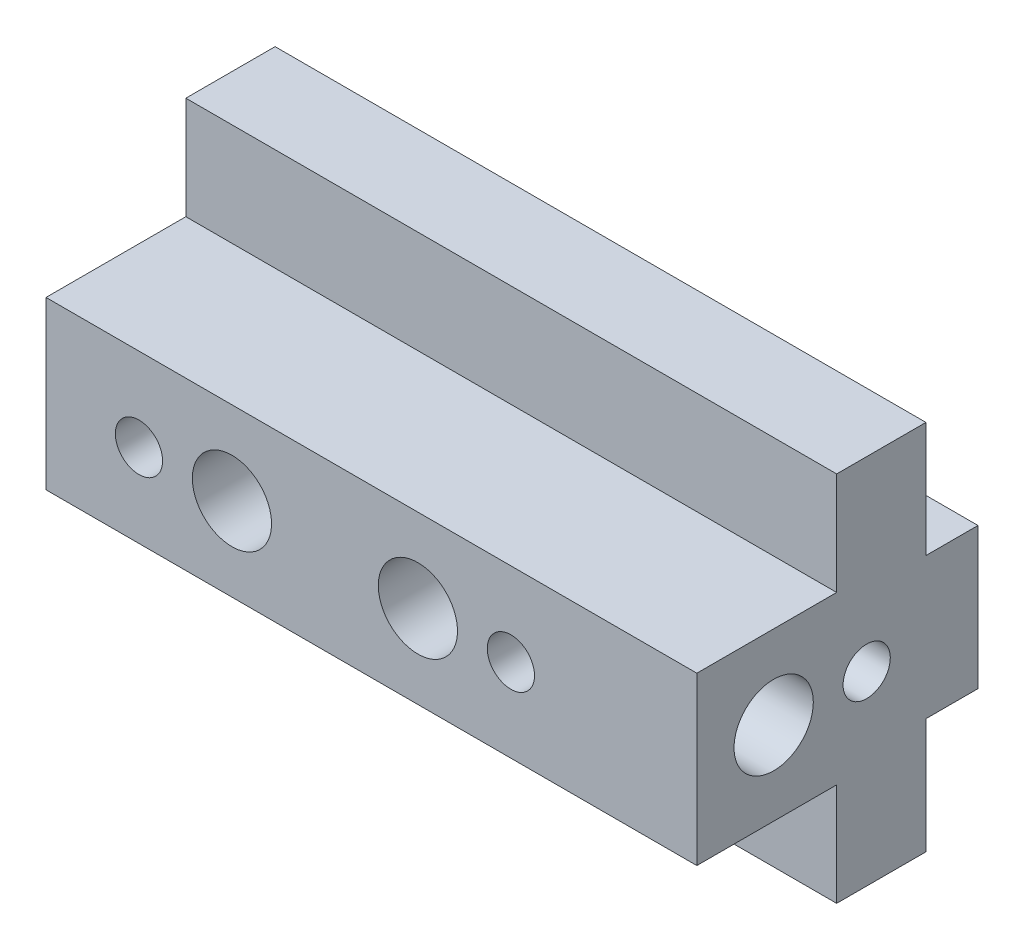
ISO-10303-21;
HEADER;
FILE_DESCRIPTION(('STEP AP214'),'2;1');
FILE_NAME('part.step','',(''),(''),'','','');
FILE_SCHEMA(('AUTOMOTIVE_DESIGN { 1 0 10303 214 1 1 1 1 }'));
ENDSEC;
DATA;
#1=APPLICATION_CONTEXT('core data for automotive mechanical design processes');
#2=APPLICATION_PROTOCOL_DEFINITION('international standard','automotive_design',2000,#1);
#3=PRODUCT_CONTEXT('',#1,'mechanical');
#4=PRODUCT('Part','Part','',(#3));
#5=PRODUCT_RELATED_PRODUCT_CATEGORY('part','',(#4));
#6=PRODUCT_DEFINITION_FORMATION('','',#4);
#7=PRODUCT_DEFINITION_CONTEXT('part definition',#1,'design');
#8=PRODUCT_DEFINITION('design','',#6,#7);
#9=PRODUCT_DEFINITION_SHAPE('','',#8);
#10=(LENGTH_UNIT() NAMED_UNIT(*) SI_UNIT(.MILLI.,.METRE.));
#11=(NAMED_UNIT(*) PLANE_ANGLE_UNIT() SI_UNIT($,.RADIAN.));
#12=(NAMED_UNIT(*) SI_UNIT($,.STERADIAN.) SOLID_ANGLE_UNIT());
#13=UNCERTAINTY_MEASURE_WITH_UNIT(LENGTH_MEASURE(1.E-05),#10,'distance_accuracy_value','');
#14=(GEOMETRIC_REPRESENTATION_CONTEXT(3) GLOBAL_UNCERTAINTY_ASSIGNED_CONTEXT((#13)) GLOBAL_UNIT_ASSIGNED_CONTEXT((#10,
#11,#12)) REPRESENTATION_CONTEXT('',''));
#15=CARTESIAN_POINT('',(0.,0.,0.));
#16=DIRECTION('',(0.,0.,1.));
#17=DIRECTION('',(1.,0.,0.));
#18=AXIS2_PLACEMENT_3D('',#15,#16,#17);
#19=CARTESIAN_POINT('',(7.30249999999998,0.123074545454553,2.81178));
#20=DIRECTION('',(1.,0.,0.));
#21=DIRECTION('',(0.,0.,-1.));
#22=AXIS2_PLACEMENT_3D('',#19,#20,#21);
#23=PLANE('',#22);
#24=CARTESIAN_POINT('',(7.30249999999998,0.,2.81178));
#25=DIRECTION('',(1.,0.,0.));
#26=DIRECTION('',(0.,0.,-1.));
#27=AXIS2_PLACEMENT_3D('',#24,#25,#26);
#28=CIRCLE('',#27,1.35382);
#29=CARTESIAN_POINT('',(7.30249999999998,0.,1.45796));
#30=VERTEX_POINT('',#29);
#31=EDGE_CURVE('E21',#30,#30,#28,.T.);
#32=ORIENTED_EDGE('',*,*,#31,.T.);
#33=EDGE_LOOP('',(#32));
#34=FACE_BOUND('',#33,.T.);
#35=ADVANCED_FACE('F17',(#34),#23,.T.);
#36=CARTESIAN_POINT('',(7.81049999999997,0.07331363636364,-0.364490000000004));
#37=DIRECTION('',(1.,0.,0.));
#38=DIRECTION('',(0.,0.,-1.));
#39=AXIS2_PLACEMENT_3D('',#36,#37,#38);
#40=PLANE('',#39);
#41=CARTESIAN_POINT('',(7.81049999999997,0.,-0.364490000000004));
#42=DIRECTION('',(1.,0.,0.));
#43=DIRECTION('',(0.,0.,-1.));
#44=AXIS2_PLACEMENT_3D('',#41,#42,#43);
#45=CIRCLE('',#44,0.80645);
#46=CARTESIAN_POINT('',(7.81049999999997,0.,-1.17094));
#47=VERTEX_POINT('',#46);
#48=EDGE_CURVE('E279',#47,#47,#45,.T.);
#49=ORIENTED_EDGE('',*,*,#48,.T.);
#50=EDGE_LOOP('',(#49));
#51=FACE_BOUND('',#50,.T.);
#52=ADVANCED_FACE('F495',(#51),#40,.T.);
#53=CARTESIAN_POINT('',(4.7625,0.,-4.8006));
#54=DIRECTION('',(1.,0.,0.));
#55=DIRECTION('',(0.,0.,-1.));
#56=AXIS2_PLACEMENT_3D('',#53,#54,#55);
#57=PLANE('',#56);
#58=DIRECTION('',(0.,1.,0.));
#59=VECTOR('',#58,1.);
#60=CARTESIAN_POINT('',(4.7625,0.,-5.43559999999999));
#61=LINE('',#60,#59);
#62=CARTESIAN_POINT('',(4.7625,2.41299999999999,-5.43559999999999));
#63=VERTEX_POINT('',#62);
#64=CARTESIAN_POINT('',(4.7625,-2.41299999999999,-5.43559999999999));
#65=VERTEX_POINT('',#64);
#66=EDGE_CURVE('E139',#63,#65,#61,.F.);
#67=ORIENTED_EDGE('',*,*,#66,.T.);
#68=DIRECTION('',(0.,0.,-1.));
#69=VECTOR('',#68,1.);
#70=CARTESIAN_POINT('',(4.7625,-2.41299999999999,-4.1656));
#71=LINE('',#70,#69);
#72=CARTESIAN_POINT('',(4.7625,-2.41299999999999,-4.1656));
#73=VERTEX_POINT('',#72);
#74=EDGE_CURVE('E183',#73,#65,#71,.T.);
#75=ORIENTED_EDGE('',*,*,#74,.F.);
#76=DIRECTION('',(0.,1.,0.));
#77=VECTOR('',#76,1.);
#78=CARTESIAN_POINT('',(4.7625,2.41299999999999,-4.1656));
#79=LINE('',#78,#77);
#80=CARTESIAN_POINT('',(4.7625,2.41299999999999,-4.1656));
#81=VERTEX_POINT('',#80);
#82=EDGE_CURVE('E163',#81,#73,#79,.F.);
#83=ORIENTED_EDGE('',*,*,#82,.F.);
#84=DIRECTION('',(0.,0.,1.));
#85=VECTOR('',#84,1.);
#86=CARTESIAN_POINT('',(4.7625,2.41299999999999,-2.38759999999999));
#87=LINE('',#86,#85);
#88=EDGE_CURVE('E155',#63,#81,#87,.T.);
#89=ORIENTED_EDGE('',*,*,#88,.F.);
#90=EDGE_LOOP('',(#67,#75,#83,#89));
#91=FACE_BOUND('',#90,.T.);
#92=ADVANCED_FACE('F162',(#91),#57,.F.);
#93=CARTESIAN_POINT('',(5.3975,0.,-5.43559999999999));
#94=DIRECTION('',(0.,0.,1.));
#95=DIRECTION('',(1.,0.,0.));
#96=AXIS2_PLACEMENT_3D('',#93,#94,#95);
#97=PLANE('',#96);
#98=DIRECTION('',(1.,0.,0.));
#99=VECTOR('',#98,1.);
#100=CARTESIAN_POINT('',(-11.1125,-2.41299999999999,-5.43559999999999));
#101=LINE('',#100,#99);
#102=CARTESIAN_POINT('',(6.0325,-2.41299999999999,-5.43559999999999));
#103=VERTEX_POINT('',#102);
#104=EDGE_CURVE('E144',#65,#103,#101,.T.);
#105=ORIENTED_EDGE('',*,*,#104,.F.);
#106=ORIENTED_EDGE('',*,*,#66,.F.);
#107=DIRECTION('',(1.,0.,0.));
#108=VECTOR('',#107,1.);
#109=CARTESIAN_POINT('',(-11.1125,2.41299999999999,-5.43559999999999));
#110=LINE('',#109,#108);
#111=CARTESIAN_POINT('',(6.0325,2.41299999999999,-5.43559999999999));
#112=VERTEX_POINT('',#111);
#113=EDGE_CURVE('E143',#112,#63,#110,.F.);
#114=ORIENTED_EDGE('',*,*,#113,.F.);
#115=DIRECTION('',(0.,1.,0.));
#116=VECTOR('',#115,1.);
#117=CARTESIAN_POINT('',(6.0325,0.,-5.43559999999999));
#118=LINE('',#117,#116);
#119=EDGE_CURVE('E148',#112,#103,#118,.F.);
#120=ORIENTED_EDGE('',*,*,#119,.T.);
#121=EDGE_LOOP('',(#105,#106,#114,#120));
#122=FACE_BOUND('',#121,.T.);
#123=ADVANCED_FACE('F141',(#122),#97,.F.);
#124=CARTESIAN_POINT('',(6.0325,0.,-4.8006));
#125=DIRECTION('',(-1.,0.,0.));
#126=DIRECTION('',(0.,0.,1.));
#127=AXIS2_PLACEMENT_3D('',#124,#125,#126);
#128=PLANE('',#127);
#129=ORIENTED_EDGE('',*,*,#119,.F.);
#130=DIRECTION('',(0.,0.,1.));
#131=VECTOR('',#130,1.);
#132=CARTESIAN_POINT('',(6.0325,2.41299999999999,-2.38759999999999));
#133=LINE('',#132,#131);
#134=CARTESIAN_POINT('',(6.0325,2.41299999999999,-4.1656));
#135=VERTEX_POINT('',#134);
#136=EDGE_CURVE('E159',#135,#112,#133,.F.);
#137=ORIENTED_EDGE('',*,*,#136,.F.);
#138=DIRECTION('',(0.,1.,0.));
#139=VECTOR('',#138,1.);
#140=CARTESIAN_POINT('',(6.0325,2.41299999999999,-4.1656));
#141=LINE('',#140,#139);
#142=CARTESIAN_POINT('',(6.0325,-2.41299999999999,-4.1656));
#143=VERTEX_POINT('',#142);
#144=EDGE_CURVE('E286',#143,#135,#141,.T.);
#145=ORIENTED_EDGE('',*,*,#144,.F.);
#146=DIRECTION('',(0.,0.,-1.));
#147=VECTOR('',#146,1.);
#148=CARTESIAN_POINT('',(6.0325,-2.41299999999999,-4.1656));
#149=LINE('',#148,#147);
#150=EDGE_CURVE('E180',#103,#143,#149,.F.);
#151=ORIENTED_EDGE('',*,*,#150,.F.);
#152=EDGE_LOOP('',(#129,#137,#145,#151));
#153=FACE_BOUND('',#152,.T.);
#154=ADVANCED_FACE('F523',(#153),#128,.F.);
#155=CARTESIAN_POINT('',(-11.1125,2.41299999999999,-4.1656));
#156=DIRECTION('',(0.,0.,-1.));
#157=DIRECTION('',(-1.,0.,0.));
#158=AXIS2_PLACEMENT_3D('',#155,#156,#157);
#159=PLANE('',#158);
#160=DIRECTION('',(0.,1.,0.));
#161=VECTOR('',#160,1.);
#162=CARTESIAN_POINT('',(11.1125,0.,-4.1656));
#163=LINE('',#162,#161);
#164=CARTESIAN_POINT('',(11.1125,-2.41299999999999,-4.1656));
#165=VERTEX_POINT('',#164);
#166=CARTESIAN_POINT('',(11.1125,2.41299999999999,-4.1656));
#167=VERTEX_POINT('',#166);
#168=EDGE_CURVE('E211',#165,#167,#163,.T.);
#169=ORIENTED_EDGE('',*,*,#168,.F.);
#170=DIRECTION('',(1.,0.,0.));
#171=VECTOR('',#170,1.);
#172=CARTESIAN_POINT('',(-11.1125,-2.41299999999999,-4.1656));
#173=LINE('',#172,#171);
#174=EDGE_CURVE('E177',#143,#165,#173,.T.);
#175=ORIENTED_EDGE('',*,*,#174,.F.);
#176=ORIENTED_EDGE('',*,*,#144,.T.);
#177=DIRECTION('',(1.,0.,0.));
#178=VECTOR('',#177,1.);
#179=CARTESIAN_POINT('',(-11.1125,2.41299999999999,-4.1656));
#180=LINE('',#179,#178);
#181=EDGE_CURVE('E170',#167,#135,#180,.F.);
#182=ORIENTED_EDGE('',*,*,#181,.F.);
#183=EDGE_LOOP('',(#169,#175,#176,#182));
#184=FACE_BOUND('',#183,.T.);
#185=ADVANCED_FACE('F340',(#184),#159,.T.);
#186=CARTESIAN_POINT('',(7.30249999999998,0.,2.81178));
#187=DIRECTION('',(1.,0.,0.));
#188=DIRECTION('',(0.,0.,-1.));
#189=AXIS2_PLACEMENT_3D('',#186,#187,#188);
#190=CYLINDRICAL_SURFACE('',#189,1.35382);
#191=CARTESIAN_POINT('',(11.1125,0.,2.81178));
#192=DIRECTION('',(1.,0.,0.));
#193=DIRECTION('',(0.,0.,-1.));
#194=AXIS2_PLACEMENT_3D('',#191,#192,#193);
#195=CIRCLE('',#194,1.35382);
#196=CARTESIAN_POINT('',(11.1125,0.,1.45796));
#197=VERTEX_POINT('',#196);
#198=EDGE_CURVE('E196',#197,#197,#195,.F.);
#199=ORIENTED_EDGE('',*,*,#198,.F.);
#200=EDGE_LOOP('',(#199));
#201=FACE_BOUND('',#200,.T.);
#202=ORIENTED_EDGE('',*,*,#31,.F.);
#203=EDGE_LOOP('',(#202));
#204=FACE_BOUND('',#203,.T.);
#205=ADVANCED_FACE('F543',(#201,#204),#190,.F.);
#206=CARTESIAN_POINT('',(7.81049999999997,0.,-0.364490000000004));
#207=DIRECTION('',(1.,0.,0.));
#208=DIRECTION('',(0.,0.,-1.));
#209=AXIS2_PLACEMENT_3D('',#206,#207,#208);
#210=CYLINDRICAL_SURFACE('',#209,0.80645);
#211=CARTESIAN_POINT('',(11.1125,0.,-0.364490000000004));
#212=DIRECTION('',(1.,0.,0.));
#213=DIRECTION('',(0.,0.,-1.));
#214=AXIS2_PLACEMENT_3D('',#211,#212,#213);
#215=CIRCLE('',#214,0.80645);
#216=CARTESIAN_POINT('',(11.1125,0.,-1.17094));
#217=VERTEX_POINT('',#216);
#218=EDGE_CURVE('E224',#217,#217,#215,.F.);
#219=ORIENTED_EDGE('',*,*,#218,.F.);
#220=EDGE_LOOP('',(#219));
#221=FACE_BOUND('',#220,.T.);
#222=ORIENTED_EDGE('',*,*,#48,.F.);
#223=EDGE_LOOP('',(#222));
#224=FACE_BOUND('',#223,.T.);
#225=ADVANCED_FACE('F554',(#221,#224),#210,.F.);
#226=CARTESIAN_POINT('',(-11.1125,-6.35,0.660400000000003));
#227=DIRECTION('',(0.,0.,1.));
#228=DIRECTION('',(1.,0.,0.));
#229=AXIS2_PLACEMENT_3D('',#226,#227,#228);
#230=PLANE('',#229);
#231=DIRECTION('',(0.,1.,0.));
#232=VECTOR('',#231,1.);
#233=CARTESIAN_POINT('',(-11.1125,-2.8448,0.660400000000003));
#234=LINE('',#233,#232);
#235=CARTESIAN_POINT('',(-11.1125,2.8448,0.660400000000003));
#236=VERTEX_POINT('',#235);
#237=CARTESIAN_POINT('',(-11.1125,6.35,0.660400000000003));
#238=VERTEX_POINT('',#237);
#239=EDGE_CURVE('E240',#236,#238,#234,.T.);
#240=ORIENTED_EDGE('',*,*,#239,.F.);
#241=DIRECTION('',(1.,0.,0.));
#242=VECTOR('',#241,1.);
#243=CARTESIAN_POINT('',(-11.1125,2.8448,0.660400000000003));
#244=LINE('',#243,#242);
#245=CARTESIAN_POINT('',(11.1125,2.8448,0.660400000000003));
#246=VERTEX_POINT('',#245);
#247=EDGE_CURVE('E218',#246,#236,#244,.F.);
#248=ORIENTED_EDGE('',*,*,#247,.F.);
#249=DIRECTION('',(0.,1.,0.));
#250=VECTOR('',#249,1.);
#251=CARTESIAN_POINT('',(11.1125,0.,0.660400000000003));
#252=LINE('',#251,#250);
#253=CARTESIAN_POINT('',(11.1125,6.35,0.660400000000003));
#254=VERTEX_POINT('',#253);
#255=EDGE_CURVE('E200',#254,#246,#252,.F.);
#256=ORIENTED_EDGE('',*,*,#255,.F.);
#257=DIRECTION('',(1.,0.,0.));
#258=VECTOR('',#257,1.);
#259=CARTESIAN_POINT('',(-11.1125,6.35,0.660400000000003));
#260=LINE('',#259,#258);
#261=EDGE_CURVE('E281',#238,#254,#260,.T.);
#262=ORIENTED_EDGE('',*,*,#261,.F.);
#263=EDGE_LOOP('',(#240,#248,#256,#262));
#264=FACE_BOUND('',#263,.T.);
#265=ADVANCED_FACE('F312',(#264),#230,.T.);
#266=CARTESIAN_POINT('',(-11.1125,6.35,0.660400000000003));
#267=DIRECTION('',(0.,1.,0.));
#268=DIRECTION('',(0.,0.,1.));
#269=AXIS2_PLACEMENT_3D('',#266,#267,#268);
#270=PLANE('',#269);
#271=DIRECTION('',(0.,0.,1.));
#272=VECTOR('',#271,1.);
#273=CARTESIAN_POINT('',(-11.1125,6.35,0.660400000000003));
#274=LINE('',#273,#272);
#275=CARTESIAN_POINT('',(-11.1125,6.35,-2.38759999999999));
#276=VERTEX_POINT('',#275);
#277=EDGE_CURVE('E238',#238,#276,#274,.F.);
#278=ORIENTED_EDGE('',*,*,#277,.F.);
#279=ORIENTED_EDGE('',*,*,#261,.T.);
#280=DIRECTION('',(0.,0.,-1.));
#281=VECTOR('',#280,1.);
#282=CARTESIAN_POINT('',(11.1125,6.35,0.198339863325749));
#283=LINE('',#282,#281);
#284=CARTESIAN_POINT('',(11.1125,6.35,-2.38759999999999));
#285=VERTEX_POINT('',#284);
#286=EDGE_CURVE('E202',#285,#254,#283,.F.);
#287=ORIENTED_EDGE('',*,*,#286,.F.);
#288=DIRECTION('',(-1.,0.,0.));
#289=VECTOR('',#288,1.);
#290=CARTESIAN_POINT('',(-11.1125,6.35,-2.38759999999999));
#291=LINE('',#290,#289);
#292=EDGE_CURVE('E172',#276,#285,#291,.F.);
#293=ORIENTED_EDGE('',*,*,#292,.F.);
#294=EDGE_LOOP('',(#278,#279,#287,#293));
#295=FACE_BOUND('',#294,.T.);
#296=ADVANCED_FACE('F308',(#295),#270,.T.);
#297=CARTESIAN_POINT('',(-11.1125,6.35,-2.38759999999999));
#298=DIRECTION('',(0.,0.,-1.));
#299=DIRECTION('',(-1.,0.,0.));
#300=AXIS2_PLACEMENT_3D('',#297,#298,#299);
#301=PLANE('',#300);
#302=DIRECTION('',(0.,1.,0.));
#303=VECTOR('',#302,1.);
#304=CARTESIAN_POINT('',(-11.1125,-2.8448,-2.38759999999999));
#305=LINE('',#304,#303);
#306=CARTESIAN_POINT('',(-11.1125,2.41299999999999,-2.38759999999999));
#307=VERTEX_POINT('',#306);
#308=EDGE_CURVE('E236',#276,#307,#305,.F.);
#309=ORIENTED_EDGE('',*,*,#308,.F.);
#310=ORIENTED_EDGE('',*,*,#292,.T.);
#311=DIRECTION('',(0.,1.,0.));
#312=VECTOR('',#311,1.);
#313=CARTESIAN_POINT('',(11.1125,0.,-2.38759999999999));
#314=LINE('',#313,#312);
#315=CARTESIAN_POINT('',(11.1125,2.41299999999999,-2.38759999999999));
#316=VERTEX_POINT('',#315);
#317=EDGE_CURVE('E205',#316,#285,#314,.T.);
#318=ORIENTED_EDGE('',*,*,#317,.F.);
#319=DIRECTION('',(1.,0.,0.));
#320=VECTOR('',#319,1.);
#321=CARTESIAN_POINT('',(-11.1125,2.41299999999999,-2.38759999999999));
#322=LINE('',#321,#320);
#323=EDGE_CURVE('E164',#307,#316,#322,.T.);
#324=ORIENTED_EDGE('',*,*,#323,.F.);
#325=EDGE_LOOP('',(#309,#310,#318,#324));
#326=FACE_BOUND('',#325,.T.);
#327=ADVANCED_FACE('F299',(#326),#301,.T.);
#328=CARTESIAN_POINT('',(-11.1125,2.41299999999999,-2.38759999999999));
#329=DIRECTION('',(0.,1.,0.));
#330=DIRECTION('',(0.,0.,1.));
#331=AXIS2_PLACEMENT_3D('',#328,#329,#330);
#332=PLANE('',#331);
#333=DIRECTION('',(0.,0.,1.));
#334=VECTOR('',#333,1.);
#335=CARTESIAN_POINT('',(-11.1125,2.41299999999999,0.660400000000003));
#336=LINE('',#335,#334);
#337=CARTESIAN_POINT('',(-11.1125,2.41299999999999,-4.1656));
#338=VERTEX_POINT('',#337);
#339=EDGE_CURVE('E234',#307,#338,#336,.F.);
#340=ORIENTED_EDGE('',*,*,#339,.F.);
#341=ORIENTED_EDGE('',*,*,#323,.T.);
#342=DIRECTION('',(0.,0.,-1.));
#343=VECTOR('',#342,1.);
#344=CARTESIAN_POINT('',(11.1125,2.41299999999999,0.198339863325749));
#345=LINE('',#344,#343);
#346=EDGE_CURVE('E208',#167,#316,#345,.F.);
#347=ORIENTED_EDGE('',*,*,#346,.F.);
#348=ORIENTED_EDGE('',*,*,#181,.T.);
#349=ORIENTED_EDGE('',*,*,#136,.T.);
#350=ORIENTED_EDGE('',*,*,#113,.T.);
#351=ORIENTED_EDGE('',*,*,#88,.T.);
#352=DIRECTION('',(-1.,0.,0.));
#353=VECTOR('',#352,1.);
#354=CARTESIAN_POINT('',(-11.1125,2.41299999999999,-4.1656));
#355=LINE('',#354,#353);
#356=EDGE_CURVE('E173',#338,#81,#355,.F.);
#357=ORIENTED_EDGE('',*,*,#356,.F.);
#358=EDGE_LOOP('',(#340,#341,#347,#348,#349,#350,#351,#357));
#359=FACE_BOUND('',#358,.T.);
#360=ADVANCED_FACE('F153',(#359),#332,.T.);
#361=CARTESIAN_POINT('',(-11.1125,2.41299999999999,-4.1656));
#362=DIRECTION('',(0.,0.,-1.));
#363=DIRECTION('',(-1.,0.,0.));
#364=AXIS2_PLACEMENT_3D('',#361,#362,#363);
#365=PLANE('',#364);
#366=DIRECTION('',(0.,1.,0.));
#367=VECTOR('',#366,1.);
#368=CARTESIAN_POINT('',(-11.1125,-2.8448,-4.1656));
#369=LINE('',#368,#367);
#370=CARTESIAN_POINT('',(-11.1125,-2.41299999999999,-4.1656));
#371=VERTEX_POINT('',#370);
#372=EDGE_CURVE('E232',#338,#371,#369,.F.);
#373=ORIENTED_EDGE('',*,*,#372,.F.);
#374=ORIENTED_EDGE('',*,*,#356,.T.);
#375=ORIENTED_EDGE('',*,*,#82,.T.);
#376=DIRECTION('',(1.,0.,0.));
#377=VECTOR('',#376,1.);
#378=CARTESIAN_POINT('',(-11.1125,-2.41299999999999,-4.1656));
#379=LINE('',#378,#377);
#380=EDGE_CURVE('E175',#371,#73,#379,.T.);
#381=ORIENTED_EDGE('',*,*,#380,.F.);
#382=EDGE_LOOP('',(#373,#374,#375,#381));
#383=FACE_BOUND('',#382,.T.);
#384=ADVANCED_FACE('F604',(#383),#365,.T.);
#385=CARTESIAN_POINT('',(-11.1125,-2.41299999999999,-4.1656));
#386=DIRECTION('',(0.,-1.,0.));
#387=DIRECTION('',(0.,0.,-1.));
#388=AXIS2_PLACEMENT_3D('',#385,#386,#387);
#389=PLANE('',#388);
#390=ORIENTED_EDGE('',*,*,#150,.T.);
#391=ORIENTED_EDGE('',*,*,#174,.T.);
#392=DIRECTION('',(0.,0.,-1.));
#393=VECTOR('',#392,1.);
#394=CARTESIAN_POINT('',(11.1125,-2.41299999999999,0.198339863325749));
#395=LINE('',#394,#393);
#396=CARTESIAN_POINT('',(11.1125,-2.41299999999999,-2.38759999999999));
#397=VERTEX_POINT('',#396);
#398=EDGE_CURVE('E213',#397,#165,#395,.T.);
#399=ORIENTED_EDGE('',*,*,#398,.F.);
#400=DIRECTION('',(-1.,0.,0.));
#401=VECTOR('',#400,1.);
#402=CARTESIAN_POINT('',(-11.1125,-2.41299999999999,-2.38759999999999));
#403=LINE('',#402,#401);
#404=CARTESIAN_POINT('',(-11.1125,-2.41299999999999,-2.38759999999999));
#405=VERTEX_POINT('',#404);
#406=EDGE_CURVE('E179',#405,#397,#403,.F.);
#407=ORIENTED_EDGE('',*,*,#406,.F.);
#408=DIRECTION('',(0.,0.,1.));
#409=VECTOR('',#408,1.);
#410=CARTESIAN_POINT('',(-11.1125,-2.41299999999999,0.660400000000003));
#411=LINE('',#410,#409);
#412=EDGE_CURVE('E230',#371,#405,#411,.T.);
#413=ORIENTED_EDGE('',*,*,#412,.F.);
#414=ORIENTED_EDGE('',*,*,#380,.T.);
#415=ORIENTED_EDGE('',*,*,#74,.T.);
#416=ORIENTED_EDGE('',*,*,#104,.T.);
#417=EDGE_LOOP('',(#390,#391,#399,#407,#413,#414,#415,#416));
#418=FACE_BOUND('',#417,.T.);
#419=ADVANCED_FACE('F337',(#418),#389,.T.);
#420=CARTESIAN_POINT('',(-11.1125,-2.41299999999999,-2.38759999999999));
#421=DIRECTION('',(0.,0.,-1.));
#422=DIRECTION('',(-1.,0.,0.));
#423=AXIS2_PLACEMENT_3D('',#420,#421,#422);
#424=PLANE('',#423);
#425=DIRECTION('',(0.,1.,0.));
#426=VECTOR('',#425,1.);
#427=CARTESIAN_POINT('',(-11.1125,-2.8448,-2.38759999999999));
#428=LINE('',#427,#426);
#429=CARTESIAN_POINT('',(-11.1125,-6.35,-2.38759999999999));
#430=VERTEX_POINT('',#429);
#431=EDGE_CURVE('E228',#405,#430,#428,.F.);
#432=ORIENTED_EDGE('',*,*,#431,.F.);
#433=ORIENTED_EDGE('',*,*,#406,.T.);
#434=DIRECTION('',(0.,1.,0.));
#435=VECTOR('',#434,1.);
#436=CARTESIAN_POINT('',(11.1125,0.,-2.38759999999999));
#437=LINE('',#436,#435);
#438=CARTESIAN_POINT('',(11.1125,-6.35,-2.38759999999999));
#439=VERTEX_POINT('',#438);
#440=EDGE_CURVE('E192',#439,#397,#437,.T.);
#441=ORIENTED_EDGE('',*,*,#440,.F.);
#442=DIRECTION('',(1.,0.,0.));
#443=VECTOR('',#442,1.);
#444=CARTESIAN_POINT('',(-11.1125,-6.35,-2.38759999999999));
#445=LINE('',#444,#443);
#446=EDGE_CURVE('E188',#430,#439,#445,.T.);
#447=ORIENTED_EDGE('',*,*,#446,.F.);
#448=EDGE_LOOP('',(#432,#433,#441,#447));
#449=FACE_BOUND('',#448,.T.);
#450=ADVANCED_FACE('F332',(#449),#424,.T.);
#451=CARTESIAN_POINT('',(-11.1125,-6.35,-2.38759999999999));
#452=DIRECTION('',(0.,-1.,0.));
#453=DIRECTION('',(0.,0.,-1.));
#454=AXIS2_PLACEMENT_3D('',#451,#452,#453);
#455=PLANE('',#454);
#456=DIRECTION('',(0.,0.,1.));
#457=VECTOR('',#456,1.);
#458=CARTESIAN_POINT('',(-11.1125,-6.35,0.660400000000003));
#459=LINE('',#458,#457);
#460=CARTESIAN_POINT('',(-11.1125,-6.35,0.660400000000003));
#461=VERTEX_POINT('',#460);
#462=EDGE_CURVE('E226',#430,#461,#459,.T.);
#463=ORIENTED_EDGE('',*,*,#462,.F.);
#464=ORIENTED_EDGE('',*,*,#446,.T.);
#465=DIRECTION('',(0.,0.,-1.));
#466=VECTOR('',#465,1.);
#467=CARTESIAN_POINT('',(11.1125,-6.35,0.198339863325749));
#468=LINE('',#467,#466);
#469=CARTESIAN_POINT('',(11.1125,-6.35,0.660400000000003));
#470=VERTEX_POINT('',#469);
#471=EDGE_CURVE('E193',#470,#439,#468,.T.);
#472=ORIENTED_EDGE('',*,*,#471,.F.);
#473=DIRECTION('',(1.,0.,0.));
#474=VECTOR('',#473,1.);
#475=CARTESIAN_POINT('',(-11.1125,-6.35,0.660400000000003));
#476=LINE('',#475,#474);
#477=EDGE_CURVE('E190',#461,#470,#476,.T.);
#478=ORIENTED_EDGE('',*,*,#477,.F.);
#479=EDGE_LOOP('',(#463,#464,#472,#478));
#480=FACE_BOUND('',#479,.T.);
#481=ADVANCED_FACE('F328',(#480),#455,.T.);
#482=CARTESIAN_POINT('',(-11.1125,-6.35,0.660400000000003));
#483=DIRECTION('',(0.,0.,1.));
#484=DIRECTION('',(1.,0.,0.));
#485=AXIS2_PLACEMENT_3D('',#482,#483,#484);
#486=PLANE('',#485);
#487=DIRECTION('',(0.,1.,0.));
#488=VECTOR('',#487,1.);
#489=CARTESIAN_POINT('',(-11.1125,-2.8448,0.660400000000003));
#490=LINE('',#489,#488);
#491=CARTESIAN_POINT('',(-11.1125,-2.8448,0.660400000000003));
#492=VERTEX_POINT('',#491);
#493=EDGE_CURVE('E55',#461,#492,#490,.T.);
#494=ORIENTED_EDGE('',*,*,#493,.F.);
#495=ORIENTED_EDGE('',*,*,#477,.T.);
#496=DIRECTION('',(0.,1.,0.));
#497=VECTOR('',#496,1.);
#498=CARTESIAN_POINT('',(11.1125,0.,0.660400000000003));
#499=LINE('',#498,#497);
#500=CARTESIAN_POINT('',(11.1125,-2.8448,0.660400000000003));
#501=VERTEX_POINT('',#500);
#502=EDGE_CURVE('E197',#501,#470,#499,.F.);
#503=ORIENTED_EDGE('',*,*,#502,.F.);
#504=DIRECTION('',(1.,0.,0.));
#505=VECTOR('',#504,1.);
#506=CARTESIAN_POINT('',(11.2395,-2.8448,0.660400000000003));
#507=LINE('',#506,#505);
#508=EDGE_CURVE('E244',#492,#501,#507,.T.);
#509=ORIENTED_EDGE('',*,*,#508,.F.);
#510=EDGE_LOOP('',(#494,#495,#503,#509));
#511=FACE_BOUND('',#510,.T.);
#512=ADVANCED_FACE('F396',(#511),#486,.T.);
#513=CARTESIAN_POINT('',(4.83581363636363,0.,2.1336));
#514=DIRECTION('',(0.,0.,1.));
#515=DIRECTION('',(1.,0.,0.));
#516=AXIS2_PLACEMENT_3D('',#513,#514,#515);
#517=PLANE('',#516);
#518=CARTESIAN_POINT('',(4.7625,0.,2.1336));
#519=DIRECTION('',(0.,0.,1.));
#520=DIRECTION('',(1.,0.,0.));
#521=AXIS2_PLACEMENT_3D('',#518,#519,#520);
#522=CIRCLE('',#521,0.80645);
#523=CARTESIAN_POINT('',(5.56895,0.,2.1336));
#524=VERTEX_POINT('',#523);
#525=EDGE_CURVE('E246',#524,#524,#522,.T.);
#526=ORIENTED_EDGE('',*,*,#525,.T.);
#527=EDGE_LOOP('',(#526));
#528=FACE_BOUND('',#527,.T.);
#529=ADVANCED_FACE('F388',(#528),#517,.T.);
#530=CARTESIAN_POINT('',(1.71045909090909,0.,0.863599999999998));
#531=DIRECTION('',(0.,0.,1.));
#532=DIRECTION('',(1.,0.,0.));
#533=AXIS2_PLACEMENT_3D('',#530,#531,#532);
#534=PLANE('',#533);
#535=CARTESIAN_POINT('',(1.5875,0.,0.863599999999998));
#536=DIRECTION('',(0.,0.,-1.));
#537=DIRECTION('',(-1.,0.,0.));
#538=AXIS2_PLACEMENT_3D('',#535,#536,#537);
#539=CIRCLE('',#538,1.35255);
#540=CARTESIAN_POINT('',(0.23495,0.,0.863599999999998));
#541=VERTEX_POINT('',#540);
#542=EDGE_CURVE('E271',#541,#541,#539,.F.);
#543=ORIENTED_EDGE('',*,*,#542,.T.);
#544=EDGE_LOOP('',(#543));
#545=FACE_BOUND('',#544,.T.);
#546=ADVANCED_FACE('F385',(#545),#534,.T.);
#547=CARTESIAN_POINT('',(-4.63954090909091,0.,0.863599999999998));
#548=DIRECTION('',(0.,0.,1.));
#549=DIRECTION('',(1.,0.,0.));
#550=AXIS2_PLACEMENT_3D('',#547,#548,#549);
#551=PLANE('',#550);
#552=CARTESIAN_POINT('',(-4.7625,0.,0.863599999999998));
#553=DIRECTION('',(0.,0.,-1.));
#554=DIRECTION('',(-1.,0.,0.));
#555=AXIS2_PLACEMENT_3D('',#552,#553,#554);
#556=CIRCLE('',#555,1.35255);
#557=CARTESIAN_POINT('',(-6.11505,0.,0.863599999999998));
#558=VERTEX_POINT('',#557);
#559=EDGE_CURVE('E257',#558,#558,#556,.F.);
#560=ORIENTED_EDGE('',*,*,#559,.T.);
#561=EDGE_LOOP('',(#560));
#562=FACE_BOUND('',#561,.T.);
#563=ADVANCED_FACE('F387',(#562),#551,.T.);
#564=CARTESIAN_POINT('',(11.1125,0.,0.198339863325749));
#565=DIRECTION('',(1.,0.,0.));
#566=DIRECTION('',(0.,0.,-1.));
#567=AXIS2_PLACEMENT_3D('',#564,#565,#566);
#568=PLANE('',#567);
#569=ORIENTED_EDGE('',*,*,#218,.T.);
#570=EDGE_LOOP('',(#569));
#571=FACE_BOUND('',#570,.T.);
#572=ORIENTED_EDGE('',*,*,#198,.T.);
#573=EDGE_LOOP('',(#572));
#574=FACE_BOUND('',#573,.T.);
#575=ORIENTED_EDGE('',*,*,#502,.T.);
#576=ORIENTED_EDGE('',*,*,#471,.T.);
#577=ORIENTED_EDGE('',*,*,#440,.T.);
#578=ORIENTED_EDGE('',*,*,#398,.T.);
#579=ORIENTED_EDGE('',*,*,#168,.T.);
#580=ORIENTED_EDGE('',*,*,#346,.T.);
#581=ORIENTED_EDGE('',*,*,#317,.T.);
#582=ORIENTED_EDGE('',*,*,#286,.T.);
#583=ORIENTED_EDGE('',*,*,#255,.T.);
#584=DIRECTION('',(0.,0.,1.));
#585=VECTOR('',#584,1.);
#586=CARTESIAN_POINT('',(11.1125,2.8448,0.660400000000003));
#587=LINE('',#586,#585);
#588=CARTESIAN_POINT('',(11.1125,2.8448,5.4356));
#589=VERTEX_POINT('',#588);
#590=EDGE_CURVE('E221',#589,#246,#587,.F.);
#591=ORIENTED_EDGE('',*,*,#590,.F.);
#592=DIRECTION('',(0.,1.,0.));
#593=VECTOR('',#592,1.);
#594=CARTESIAN_POINT('',(11.1125,0.,5.4356));
#595=LINE('',#594,#593);
#596=CARTESIAN_POINT('',(11.1125,-2.8448,5.4356));
#597=VERTEX_POINT('',#596);
#598=EDGE_CURVE('E256',#597,#589,#595,.T.);
#599=ORIENTED_EDGE('',*,*,#598,.F.);
#600=DIRECTION('',(0.,0.,-1.));
#601=VECTOR('',#600,1.);
#602=CARTESIAN_POINT('',(11.1125,-2.8448,0.660400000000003));
#603=LINE('',#602,#601);
#604=EDGE_CURVE('E49',#501,#597,#603,.F.);
#605=ORIENTED_EDGE('',*,*,#604,.F.);
#606=EDGE_LOOP('',(#575,#576,#577,#578,#579,#580,#581,#582,#583,#591,#599,#605));
#607=FACE_BOUND('',#606,.T.);
#608=ADVANCED_FACE('F305',(#571,#574,#607),#568,.T.);
#609=CARTESIAN_POINT('',(-11.1125,2.8448,0.660400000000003));
#610=DIRECTION('',(0.,1.,0.));
#611=DIRECTION('',(0.,0.,1.));
#612=AXIS2_PLACEMENT_3D('',#609,#610,#611);
#613=PLANE('',#612);
#614=DIRECTION('',(0.,0.,1.));
#615=VECTOR('',#614,1.);
#616=CARTESIAN_POINT('',(-11.1125,2.8448,0.660400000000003));
#617=LINE('',#616,#615);
#618=CARTESIAN_POINT('',(-11.1125,2.8448,5.4356));
#619=VERTEX_POINT('',#618);
#620=EDGE_CURVE('E220',#619,#236,#617,.F.);
#621=ORIENTED_EDGE('',*,*,#620,.F.);
#622=DIRECTION('',(1.,0.,0.));
#623=VECTOR('',#622,1.);
#624=CARTESIAN_POINT('',(0.063499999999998,2.8448,5.4356));
#625=LINE('',#624,#623);
#626=EDGE_CURVE('E254',#589,#619,#625,.F.);
#627=ORIENTED_EDGE('',*,*,#626,.F.);
#628=ORIENTED_EDGE('',*,*,#590,.T.);
#629=ORIENTED_EDGE('',*,*,#247,.T.);
#630=EDGE_LOOP('',(#621,#627,#628,#629));
#631=FACE_BOUND('',#630,.T.);
#632=ADVANCED_FACE('F319',(#631),#613,.T.);
#633=CARTESIAN_POINT('',(-11.1125,-2.8448,0.660400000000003));
#634=DIRECTION('',(-1.,0.,0.));
#635=DIRECTION('',(0.,0.,1.));
#636=AXIS2_PLACEMENT_3D('',#633,#634,#635);
#637=PLANE('',#636);
#638=ORIENTED_EDGE('',*,*,#493,.T.);
#639=DIRECTION('',(0.,0.,-1.));
#640=VECTOR('',#639,1.);
#641=CARTESIAN_POINT('',(-11.1125,-2.8448,0.660400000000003));
#642=LINE('',#641,#640);
#643=CARTESIAN_POINT('',(-11.1125,-2.8448,5.4356));
#644=VERTEX_POINT('',#643);
#645=EDGE_CURVE('E247',#644,#492,#642,.T.);
#646=ORIENTED_EDGE('',*,*,#645,.F.);
#647=DIRECTION('',(0.,1.,0.));
#648=VECTOR('',#647,1.);
#649=CARTESIAN_POINT('',(-11.1125,0.,5.4356));
#650=LINE('',#649,#648);
#651=EDGE_CURVE('E36',#619,#644,#650,.F.);
#652=ORIENTED_EDGE('',*,*,#651,.F.);
#653=ORIENTED_EDGE('',*,*,#620,.T.);
#654=ORIENTED_EDGE('',*,*,#239,.T.);
#655=ORIENTED_EDGE('',*,*,#277,.T.);
#656=ORIENTED_EDGE('',*,*,#308,.T.);
#657=ORIENTED_EDGE('',*,*,#339,.T.);
#658=ORIENTED_EDGE('',*,*,#372,.T.);
#659=ORIENTED_EDGE('',*,*,#412,.T.);
#660=ORIENTED_EDGE('',*,*,#431,.T.);
#661=ORIENTED_EDGE('',*,*,#462,.T.);
#662=EDGE_LOOP('',(#638,#646,#652,#653,#654,#655,#656,#657,#658,#659,#660,#661));
#663=FACE_BOUND('',#662,.T.);
#664=ADVANCED_FACE('F342',(#663),#637,.T.);
#665=CARTESIAN_POINT('',(11.2395,-2.8448,0.660400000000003));
#666=DIRECTION('',(0.,-1.,0.));
#667=DIRECTION('',(0.,0.,-1.));
#668=AXIS2_PLACEMENT_3D('',#665,#666,#667);
#669=PLANE('',#668);
#670=ORIENTED_EDGE('',*,*,#645,.T.);
#671=ORIENTED_EDGE('',*,*,#508,.T.);
#672=ORIENTED_EDGE('',*,*,#604,.T.);
#673=DIRECTION('',(1.,0.,0.));
#674=VECTOR('',#673,1.);
#675=CARTESIAN_POINT('',(0.063499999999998,-2.8448,5.4356));
#676=LINE('',#675,#674);
#677=EDGE_CURVE('E250',#644,#597,#676,.T.);
#678=ORIENTED_EDGE('',*,*,#677,.F.);
#679=EDGE_LOOP('',(#670,#671,#672,#678));
#680=FACE_BOUND('',#679,.T.);
#681=ADVANCED_FACE('F344',(#680),#669,.T.);
#682=CARTESIAN_POINT('',(4.7625,0.,2.1336));
#683=DIRECTION('',(0.,0.,1.));
#684=DIRECTION('',(1.,0.,0.));
#685=AXIS2_PLACEMENT_3D('',#682,#683,#684);
#686=CYLINDRICAL_SURFACE('',#685,0.80645);
#687=CARTESIAN_POINT('',(4.7625,0.,5.4356));
#688=DIRECTION('',(0.,0.,1.));
#689=DIRECTION('',(1.,0.,0.));
#690=AXIS2_PLACEMENT_3D('',#687,#688,#689);
#691=CIRCLE('',#690,0.80645);
#692=CARTESIAN_POINT('',(5.56895,0.,5.4356));
#693=VERTEX_POINT('',#692);
#694=EDGE_CURVE('E252',#693,#693,#691,.F.);
#695=ORIENTED_EDGE('',*,*,#694,.F.);
#696=EDGE_LOOP('',(#695));
#697=FACE_BOUND('',#696,.T.);
#698=ORIENTED_EDGE('',*,*,#525,.F.);
#699=EDGE_LOOP('',(#698));
#700=FACE_BOUND('',#699,.T.);
#701=ADVANCED_FACE('F346',(#697,#700),#686,.F.);
#702=CARTESIAN_POINT('',(1.5875,0.,5.4356));
#703=DIRECTION('',(0.,0.,-1.));
#704=DIRECTION('',(-1.,0.,0.));
#705=AXIS2_PLACEMENT_3D('',#702,#703,#704);
#706=CYLINDRICAL_SURFACE('',#705,1.35255);
#707=CARTESIAN_POINT('',(1.5875,0.,5.4356));
#708=DIRECTION('',(0.,0.,-1.));
#709=DIRECTION('',(-1.,0.,0.));
#710=AXIS2_PLACEMENT_3D('',#707,#708,#709);
#711=CIRCLE('',#710,1.35255);
#712=CARTESIAN_POINT('',(0.23495,0.,5.4356));
#713=VERTEX_POINT('',#712);
#714=EDGE_CURVE('E264',#713,#713,#711,.T.);
#715=ORIENTED_EDGE('',*,*,#714,.F.);
#716=EDGE_LOOP('',(#715));
#717=FACE_BOUND('',#716,.T.);
#718=ORIENTED_EDGE('',*,*,#542,.F.);
#719=EDGE_LOOP('',(#718));
#720=FACE_BOUND('',#719,.T.);
#721=ADVANCED_FACE('F353',(#717,#720),#706,.F.);
#722=CARTESIAN_POINT('',(-4.7625,0.,5.4356));
#723=DIRECTION('',(0.,0.,-1.));
#724=DIRECTION('',(-1.,0.,0.));
#725=AXIS2_PLACEMENT_3D('',#722,#723,#724);
#726=CYLINDRICAL_SURFACE('',#725,1.35255);
#727=CARTESIAN_POINT('',(-4.7625,0.,5.4356));
#728=DIRECTION('',(0.,0.,-1.));
#729=DIRECTION('',(-1.,0.,0.));
#730=AXIS2_PLACEMENT_3D('',#727,#728,#729);
#731=CIRCLE('',#730,1.35255);
#732=CARTESIAN_POINT('',(-6.11505,0.,5.4356));
#733=VERTEX_POINT('',#732);
#734=EDGE_CURVE('E261',#733,#733,#731,.T.);
#735=ORIENTED_EDGE('',*,*,#734,.F.);
#736=EDGE_LOOP('',(#735));
#737=FACE_BOUND('',#736,.T.);
#738=ORIENTED_EDGE('',*,*,#559,.F.);
#739=EDGE_LOOP('',(#738));
#740=FACE_BOUND('',#739,.T.);
#741=ADVANCED_FACE('F369',(#737,#740),#726,.F.);
#742=CARTESIAN_POINT('',(-7.86418636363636,0.,2.1336));
#743=DIRECTION('',(0.,0.,1.));
#744=DIRECTION('',(1.,0.,0.));
#745=AXIS2_PLACEMENT_3D('',#742,#743,#744);
#746=PLANE('',#745);
#747=CARTESIAN_POINT('',(-7.9375,0.,2.1336));
#748=DIRECTION('',(0.,0.,1.));
#749=DIRECTION('',(1.,0.,0.));
#750=AXIS2_PLACEMENT_3D('',#747,#748,#749);
#751=CIRCLE('',#750,0.80645);
#752=CARTESIAN_POINT('',(-7.13105,0.,2.1336));
#753=VERTEX_POINT('',#752);
#754=EDGE_CURVE('E27',#753,#753,#751,.T.);
#755=ORIENTED_EDGE('',*,*,#754,.T.);
#756=EDGE_LOOP('',(#755));
#757=FACE_BOUND('',#756,.T.);
#758=ADVANCED_FACE('F362',(#757),#746,.T.);
#759=CARTESIAN_POINT('',(0.063499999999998,0.,5.4356));
#760=DIRECTION('',(0.,0.,1.));
#761=DIRECTION('',(1.,0.,0.));
#762=AXIS2_PLACEMENT_3D('',#759,#760,#761);
#763=PLANE('',#762);
#764=CARTESIAN_POINT('',(-7.9375,0.,5.4356));
#765=DIRECTION('',(0.,0.,1.));
#766=DIRECTION('',(1.,0.,0.));
#767=AXIS2_PLACEMENT_3D('',#764,#765,#766);
#768=CIRCLE('',#767,0.80645);
#769=CARTESIAN_POINT('',(-7.13105,0.,5.4356));
#770=VERTEX_POINT('',#769);
#771=EDGE_CURVE('E11',#770,#770,#768,.F.);
#772=ORIENTED_EDGE('',*,*,#771,.T.);
#773=EDGE_LOOP('',(#772));
#774=FACE_BOUND('',#773,.T.);
#775=ORIENTED_EDGE('',*,*,#734,.T.);
#776=EDGE_LOOP('',(#775));
#777=FACE_BOUND('',#776,.T.);
#778=ORIENTED_EDGE('',*,*,#714,.T.);
#779=EDGE_LOOP('',(#778));
#780=FACE_BOUND('',#779,.T.);
#781=ORIENTED_EDGE('',*,*,#694,.T.);
#782=EDGE_LOOP('',(#781));
#783=FACE_BOUND('',#782,.T.);
#784=ORIENTED_EDGE('',*,*,#651,.T.);
#785=ORIENTED_EDGE('',*,*,#677,.T.);
#786=ORIENTED_EDGE('',*,*,#598,.T.);
#787=ORIENTED_EDGE('',*,*,#626,.T.);
#788=EDGE_LOOP('',(#784,#785,#786,#787));
#789=FACE_BOUND('',#788,.T.);
#790=ADVANCED_FACE('F320',(#774,#777,#780,#783,#789),#763,.T.);
#791=CARTESIAN_POINT('',(-7.9375,0.,2.1336));
#792=DIRECTION('',(0.,0.,1.));
#793=DIRECTION('',(1.,0.,0.));
#794=AXIS2_PLACEMENT_3D('',#791,#792,#793);
#795=CYLINDRICAL_SURFACE('',#794,0.80645);
#796=ORIENTED_EDGE('',*,*,#771,.F.);
#797=EDGE_LOOP('',(#796));
#798=FACE_BOUND('',#797,.T.);
#799=ORIENTED_EDGE('',*,*,#754,.F.);
#800=EDGE_LOOP('',(#799));
#801=FACE_BOUND('',#800,.T.);
#802=ADVANCED_FACE('F19',(#798,#801),#795,.F.);
#803=CLOSED_SHELL('',(#35,#52,#92,#123,#154,#185,#205,#225,#265,#296,#327,#360,#384,#419,#450,
#481,#512,#529,#546,#563,#608,#632,#664,#681,#701,#721,#741,#758,#790,#802));
#804=MANIFOLD_SOLID_BREP('B1',#803);
#805=ADVANCED_BREP_SHAPE_REPRESENTATION('',(#18,#804),#14);
#806=SHAPE_DEFINITION_REPRESENTATION(#9,#805);
ENDSEC;
END-ISO-10303-21;
